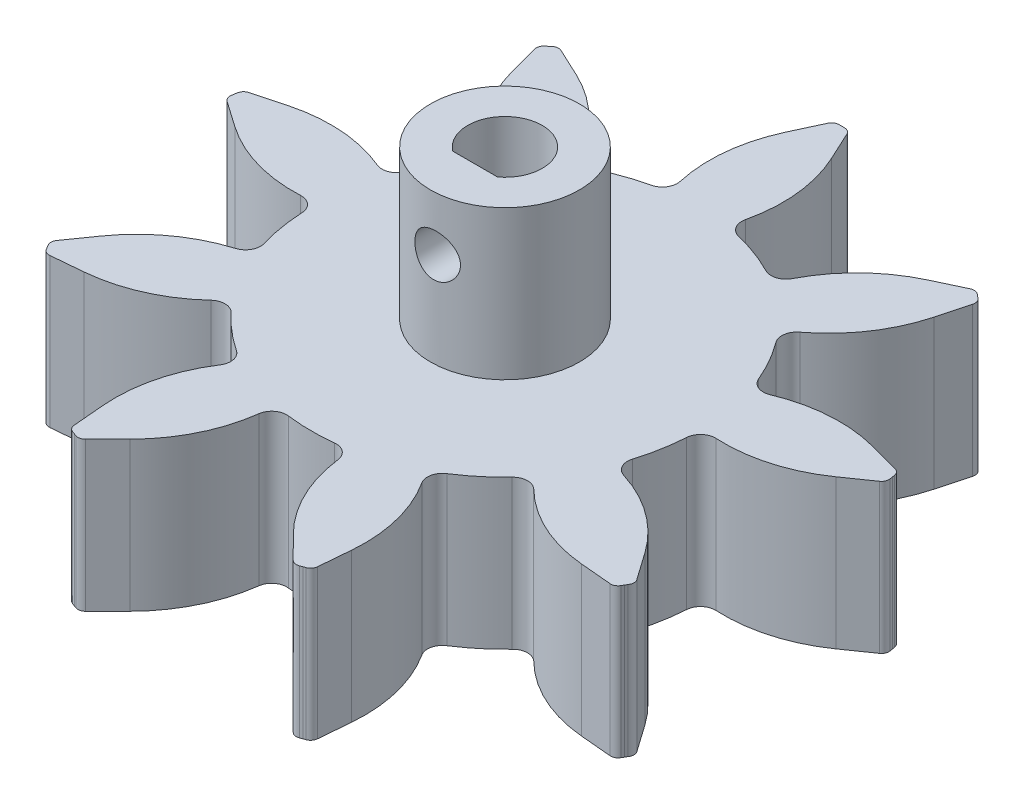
from build123d import *

# Parameters (mm, degrees)
BOSS_EXTRUDE1_DEPTH     = 10
SKETCH2_R               = 5
BOSS_EXTRUDE3_DEPTH     = 10
CUT_EXTRUDE1_DEPTH      = 5
CUT_EXTRUDE1_DEPTH_BACK = 2
SKETCH4_R               = 1.45


with BuildPart() as part:
    # Sketch1 → Boss-Extrude1 (new body)
    with BuildSketch(Plane(origin=(0, 0, 0), x_dir=(1, 0, 0), z_dir=(0, 1, 0))):
        with BuildLine():
            Line((0.638480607, 26.006805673), (0.819865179, 26.006572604))
            ThreePointArc((0.819865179, 26.006572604), (1.088462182, 25.927892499), (1.272695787, 25.717196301))
            Line((1.272695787, 25.717196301), (2.164739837, 23.7966206))
            ThreePointArc((2.164739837, 23.7966206), (3.040805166, 20.626505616), (2.841050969, 17.343638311))
            ThreePointArc((2.841050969, 17.343638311), (2.965492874, 16.593022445), (3.582086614, 16.147239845))
            ThreePointArc((3.582086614, 16.147239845), (5.070856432, 15.693859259), (6.494779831, 15.0658213))
            ThreePointArc((6.494779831, 15.0658213), (7.257207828, 15.002576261), (7.841218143, 15.496770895))
            ThreePointArc((7.841218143, 15.496770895), (9.794693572, 18.1192657), (12.489761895, 19.97133265))
            Line((12.489761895, 19.97133265), (14.407629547, 20.869184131))
            ThreePointArc((14.407629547, 20.869184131), (14.684193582, 20.912163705), (14.94052542, 20.799785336))
            Line((14.94052542, 20.799785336), (15.218422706, 20.566601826))
            ThreePointArc((15.218422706, 20.566601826), (15.373605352, 20.333678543), (15.379303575, 20.053852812))
            Line((15.379303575, 20.053852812), (14.828126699, 18.009211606))
            ThreePointArc((14.828126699, 18.009211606), (13.461521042, 15.0176387), (11.198314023, 12.631215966))
            ThreePointArc((11.198314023, 12.631215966), (10.811155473, 11.976221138), (10.99695015, 11.238393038))
            ThreePointArc((10.99695015, 11.238393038), (11.845986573, 9.934120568), (12.533080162, 8.537735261))
            ThreePointArc((12.533080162, 8.537735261), (13.076480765, 7.999207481), (13.841520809, 8.002387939))
            ThreePointArc((13.841520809, 8.002387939), (17.023676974, 8.75566571), (20.278704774, 8.44207478))
            Line((20.278704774, 8.44207478), (22.325004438, 7.897087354))
            ThreePointArc((22.325004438, 7.897087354), (22.564491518, 7.752239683), (22.688617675, 7.501385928))
            Line((22.688617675, 7.501385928), (22.720344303, 7.322797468))
            Line((22.720344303, 7.322797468), (22.751611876, 7.144128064))
            ThreePointArc((22.751611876, 7.144128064), (22.720768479, 6.865948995), (22.545265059, 6.647927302))
            Line((22.545265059, 6.647927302), (20.808769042, 5.435930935))
            ThreePointArc((20.808769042, 5.435930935), (17.838942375, 4.022690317), (14.57126225, 3.649345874))
            ThreePointArc((14.57126225, 3.649345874), (13.853659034, 3.396451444), (13.521719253, 2.711815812))
            ThreePointArc((13.521719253, 2.711815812), (13.333748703, 1.16693504), (12.962513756, -0.34441341))
            ThreePointArc((12.962513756, -0.34441341), (13.032623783, -1.106240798), (13.620722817, -1.595562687))
            ThreePointArc((13.620722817, -1.595562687), (16.542593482, -3.063968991), (18.834517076, -5.39648512))
            Line((18.834517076, -5.39648512), (20.051762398, -7.129305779))
            ThreePointArc((20.051762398, -7.129305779), (20.198928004, -7.446371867), (20.10244916, -7.782348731))
            Line((20.10244916, -7.782348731), (20.011958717, -7.939548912))
            Line((20.011958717, -7.939548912), (19.921064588, -8.096516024))
            ThreePointArc((19.921064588, -8.096516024), (19.718627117, -8.2897878), (19.444042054, -8.343990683))
            Line((19.444042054, -8.343990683), (17.334752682, -8.156235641))
            ThreePointArc((17.334752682, -8.156235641), (14.11807811, -7.296245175), (11.381655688, -5.399255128))
            ThreePointArc((11.381655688, -5.399255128), (10.669382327, -5.131717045), (9.975026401, -5.442811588))
            ThreePointArc((9.975026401, -5.442811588), (8.838002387, -6.505433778), (7.58214386, -7.424568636))
            ThreePointArc((7.58214386, -7.424568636), (7.146158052, -8.05322813), (7.282138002, -8.806093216))
            ThreePointArc((7.282138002, -8.806093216), (8.57654741, -11.809099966), (8.832950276, -15.069131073))
            Line((8.832950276, -15.069131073), (8.651578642, -17.178978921))
            ThreePointArc((8.651578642, -17.178978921), (8.550518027, -17.439980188), (8.325029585, -17.605780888))
            Line((8.325029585, -17.605780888), (8.154663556, -17.668037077))
            Line((8.154663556, -17.668037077), (7.984138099, -17.729855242))
            ThreePointArc((7.984138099, -17.729855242), (7.704829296, -17.747785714), (7.459643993, -17.612807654))
            Line((7.459643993, -17.612807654), (5.964521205, -16.113153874))
            ThreePointArc((5.964521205, -16.113153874), (4.057045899, -13.433852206), (3.121946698, -10.280646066))
            ThreePointArc((3.121946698, -10.280646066), (2.748283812, -9.617859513), (2.016408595, -9.409848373))
            ThreePointArc((2.016408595, -9.409848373), (0.462357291, -9.492999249), (-1.090494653, -9.389847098))
            ThreePointArc((-1.090494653, -9.389847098), (-1.828573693, -9.591181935), (-2.208339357, -10.255316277))
            ThreePointArc((-2.208339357, -10.255316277), (-3.147059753, -13.38778324), (-5.046151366, -16.04992454))
            Line((-5.046151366, -16.04992454), (-6.541274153, -17.54957832))
            ThreePointArc((-6.541274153, -17.54957832), (-6.786459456, -17.684556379), (-7.065768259, -17.666625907))
            Line((-7.065768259, -17.666625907), (-7.236293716, -17.604807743))
            Line((-7.236293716, -17.604807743), (-7.406659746, -17.542551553))
            ThreePointArc((-7.406659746, -17.542551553), (-7.632148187, -17.376750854), (-7.733208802, -17.115749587))
            Line((-7.733208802, -17.115749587), (-7.914580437, -15.005901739))
            ThreePointArc((-7.914580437, -15.005901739), (-7.65356938, -11.727336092), (-6.34305509, -8.71076987))
            ThreePointArc((-6.34305509, -8.71076987), (-6.203266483, -7.962860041), (-6.630208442, -7.333073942))
            ThreePointArc((-6.630208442, -7.333073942), (-7.874129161, -6.397846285), (-8.997377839, -5.320673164))
            ThreePointArc((-8.997377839, -5.320673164), (-9.692194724, -5.000476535), (-10.410009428, -5.265124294))
            ThreePointArc((-10.410009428, -5.265124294), (-13.142621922, -7.061335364), (-16.308601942, -7.879941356))
            Line((-16.308601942, -7.879941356), (-18.417891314, -8.067696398))
            ThreePointArc((-18.417891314, -8.067696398), (-18.692476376, -8.013493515), (-18.894913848, -7.820221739))
            Line((-18.894913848, -7.820221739), (-18.985807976, -7.663254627))
            Line((-18.985807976, -7.663254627), (-19.076298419, -7.506054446))
            ThreePointArc((-19.076298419, -7.506054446), (-19.142457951, -7.234102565), (-19.052106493, -6.969203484))
            Line((-19.052106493, -6.969203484), (-17.834861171, -5.236382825))
            ThreePointArc((-17.834861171, -5.236382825), (-15.527493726, -2.892630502), (-12.584570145, -1.424189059))
            ThreePointArc((-12.584570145, -1.424189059), (-11.996738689, -0.941111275), (-11.918976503, -0.184234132))
            ThreePointArc((-11.918976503, -0.184234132), (-12.270722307, 1.331768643), (-12.43878718, 2.87894146))
            ThreePointArc((-12.43878718, 2.87894146), (-12.765229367, 3.570845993), (-13.485219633, 3.829516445))
            ThreePointArc((-13.485219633, 3.829516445), (-16.73310447, 4.21002839), (-19.684575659, 5.617992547))
            Line((-19.684575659, 5.617992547), (-21.421071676, 6.829988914))
            ThreePointArc((-21.421071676, 6.829988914), (-21.596575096, 7.048010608), (-21.627418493, 7.326189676))
            Line((-21.627418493, 7.326189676), (-21.564424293, 7.68344754))
            ThreePointArc((-21.564424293, 7.68344754), (-21.440298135, 7.934301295), (-21.200811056, 8.079148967))
            Line((-21.200811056, 8.079148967), (-19.154511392, 8.624136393))
            ThreePointArc((-19.154511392, 8.624136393), (-15.880430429, 8.936407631), (-12.682124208, 8.169624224))
            ThreePointArc((-12.682124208, 8.169624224), (-11.921302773, 8.161832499), (-11.375222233, 8.691649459))
            ThreePointArc((-11.375222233, 8.691649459), (-10.670207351, 10.079072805), (-9.804448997, 11.372305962))
            ThreePointArc((-9.804448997, 11.372305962), (-9.60977056, 12.112168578), (-9.99504494, 12.773122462))
            ThreePointArc((-9.99504494, 12.773122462), (-12.238480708, 15.152311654), (-13.594416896, 18.128043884))
            Line((-13.594416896, 18.128043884), (-14.145593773, 20.17268509))
            ThreePointArc((-14.145593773, 20.17268509), (-14.13989555, 20.452510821), (-13.984712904, 20.685434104))
            Line((-13.984712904, 20.685434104), (-13.845914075, 20.802204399))
            Line((-13.845914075, 20.802204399), (-13.706815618, 20.918617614))
            ThreePointArc((-13.706815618, 20.918617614), (-13.45048378, 21.030995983), (-13.173919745, 20.988016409))
            Line((-13.173919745, 20.988016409), (-11.256052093, 20.090164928))
            ThreePointArc((-11.256052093, 20.090164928), (-8.547236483, 18.224839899), (-6.590070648, 15.581618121))
            ThreePointArc((-6.590070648, 15.581618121), (-6.012256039, 15.086602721), (-5.253374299, 15.141452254))
            ThreePointArc((-5.253374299, 15.141452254), (-3.82148303, 15.751105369), (-2.326999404, 16.185280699))
            ThreePointArc((-2.326999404, 16.185280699), (-1.702292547, 16.626911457), (-1.572576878, 17.380881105))
            ThreePointArc((-1.572576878, 17.380881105), (-1.761835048, 20.645498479), (-0.887778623, 23.7966206))
            Line((-0.887778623, 23.7966206), (0.004265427, 25.717196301))
            ThreePointArc((0.004265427, 25.717196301), (0.188499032, 25.927892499), (0.457096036, 26.006572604))
            Line((0.457096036, 26.006572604), (0.638480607, 26.006805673))
        make_face()
        with BuildLine():
            Line((2.046045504, 1.506731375), (-0.953954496, 1.506731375))
            ThreePointArc((-0.953954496, 1.506731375), (0.546045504, 6.006731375), (2.046045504, 1.506731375))
        make_face(mode=Mode.SUBTRACT)
    extrude(amount=BOSS_EXTRUDE1_DEPTH)

    # Sketch2 → Boss-Extrude3 (add)
    with BuildSketch(Plane(origin=(0, 10, 0), x_dir=(1, 0, 0), z_dir=(0, 1, 0))):
        with Locations(Location((0.546045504, 3.506731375, 0), (0, 0, 270))):
            Circle(SKETCH2_R)
        with BuildLine():
            Line((-0.953954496, 1.506731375), (2.046045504, 1.506731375))
            ThreePointArc((2.046045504, 1.506731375), (0.546045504, 6.006731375), (-0.953954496, 1.506731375))
        make_face(mode=Mode.SUBTRACT)
    extrude(amount=BOSS_EXTRUDE3_DEPTH)

    # Sketch4 → Cut-Extrude1 (cut, two sides: drawn at the far end of the back side and taken through both)
    with BuildSketch(Plane.XY.offset(-CUT_EXTRUDE1_DEPTH_BACK)):
        with Locations((0.808904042, 16.335772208)):
            Circle(SKETCH4_R)
    extrude(amount=CUT_EXTRUDE1_DEPTH + CUT_EXTRUDE1_DEPTH_BACK, mode=Mode.SUBTRACT)


solid = part.part
